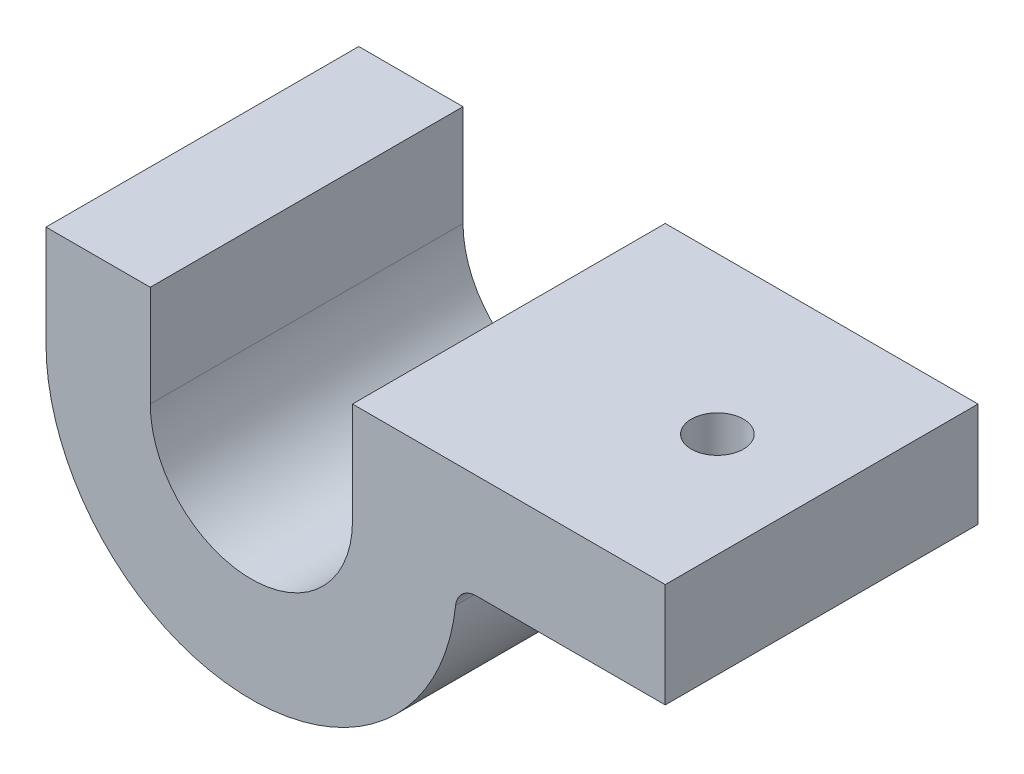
ISO-10303-21;
HEADER;
FILE_DESCRIPTION(('STEP AP214'),'2;1');
FILE_NAME('part.step','',(''),(''),'','','');
FILE_SCHEMA(('AUTOMOTIVE_DESIGN { 1 0 10303 214 1 1 1 1 }'));
ENDSEC;
DATA;
#1=APPLICATION_CONTEXT('core data for automotive mechanical design processes');
#2=APPLICATION_PROTOCOL_DEFINITION('international standard','automotive_design',2000,#1);
#3=PRODUCT_CONTEXT('',#1,'mechanical');
#4=PRODUCT('Part','Part','',(#3));
#5=PRODUCT_RELATED_PRODUCT_CATEGORY('part','',(#4));
#6=PRODUCT_DEFINITION_FORMATION('','',#4);
#7=PRODUCT_DEFINITION_CONTEXT('part definition',#1,'design');
#8=PRODUCT_DEFINITION('design','',#6,#7);
#9=PRODUCT_DEFINITION_SHAPE('','',#8);
#10=(LENGTH_UNIT() NAMED_UNIT(*) SI_UNIT(.MILLI.,.METRE.));
#11=(NAMED_UNIT(*) PLANE_ANGLE_UNIT() SI_UNIT($,.RADIAN.));
#12=(NAMED_UNIT(*) SI_UNIT($,.STERADIAN.) SOLID_ANGLE_UNIT());
#13=UNCERTAINTY_MEASURE_WITH_UNIT(LENGTH_MEASURE(1.E-05),#10,'distance_accuracy_value','');
#14=(GEOMETRIC_REPRESENTATION_CONTEXT(3) GLOBAL_UNCERTAINTY_ASSIGNED_CONTEXT((#13)) GLOBAL_UNIT_ASSIGNED_CONTEXT((#10,
#11,#12)) REPRESENTATION_CONTEXT('',''));
#15=CARTESIAN_POINT('',(0.,0.,0.));
#16=DIRECTION('',(0.,0.,1.));
#17=DIRECTION('',(1.,0.,0.));
#18=AXIS2_PLACEMENT_3D('',#15,#16,#17);
#19=CARTESIAN_POINT('',(-9.85,4.85,-15.));
#20=DIRECTION('',(0.,1.,0.));
#21=DIRECTION('',(0.,0.,1.));
#22=AXIS2_PLACEMENT_3D('',#19,#20,#21);
#23=PLANE('',#22);
#24=DIRECTION('',(-1.,0.,0.));
#25=VECTOR('',#24,1.);
#26=CARTESIAN_POINT('',(-9.85,4.85,0.));
#27=LINE('',#26,#25);
#28=CARTESIAN_POINT('',(-4.85,4.85,0.));
#29=VERTEX_POINT('',#28);
#30=CARTESIAN_POINT('',(-9.85,4.85,0.));
#31=VERTEX_POINT('',#30);
#32=EDGE_CURVE('E157',#29,#31,#27,.T.);
#33=ORIENTED_EDGE('',*,*,#32,.F.);
#34=DIRECTION('',(0.,0.,1.));
#35=VECTOR('',#34,1.);
#36=CARTESIAN_POINT('',(-4.85,4.85,-15.));
#37=LINE('',#36,#35);
#38=CARTESIAN_POINT('',(-4.85,4.85,-15.));
#39=VERTEX_POINT('',#38);
#40=EDGE_CURVE('E131',#39,#29,#37,.T.);
#41=ORIENTED_EDGE('',*,*,#40,.F.);
#42=DIRECTION('',(-1.,0.,0.));
#43=VECTOR('',#42,1.);
#44=CARTESIAN_POINT('',(-9.85,4.85,-15.));
#45=LINE('',#44,#43);
#46=CARTESIAN_POINT('',(-9.85,4.85,-15.));
#47=VERTEX_POINT('',#46);
#48=EDGE_CURVE('E126',#39,#47,#45,.T.);
#49=ORIENTED_EDGE('',*,*,#48,.T.);
#50=DIRECTION('',(0.,0.,1.));
#51=VECTOR('',#50,1.);
#52=CARTESIAN_POINT('',(-9.85,4.85,-15.));
#53=LINE('',#52,#51);
#54=EDGE_CURVE('E108',#47,#31,#53,.T.);
#55=ORIENTED_EDGE('',*,*,#54,.T.);
#56=EDGE_LOOP('',(#33,#41,#49,#55));
#57=FACE_BOUND('',#56,.T.);
#58=ADVANCED_FACE('F33',(#57),#23,.T.);
#59=CARTESIAN_POINT('',(-4.85,4.85,-15.));
#60=DIRECTION('',(1.,0.,0.));
#61=DIRECTION('',(0.,0.,-1.));
#62=AXIS2_PLACEMENT_3D('',#59,#60,#61);
#63=PLANE('',#62);
#64=DIRECTION('',(0.,1.,0.));
#65=VECTOR('',#64,1.);
#66=CARTESIAN_POINT('',(-4.85,4.85,0.));
#67=LINE('',#66,#65);
#68=CARTESIAN_POINT('',(-4.85,0.,0.));
#69=VERTEX_POINT('',#68);
#70=EDGE_CURVE('E132',#69,#29,#67,.T.);
#71=ORIENTED_EDGE('',*,*,#70,.F.);
#72=DIRECTION('',(0.,0.,1.));
#73=VECTOR('',#72,1.);
#74=CARTESIAN_POINT('',(-4.85,0.,-15.));
#75=LINE('',#74,#73);
#76=CARTESIAN_POINT('',(-4.85,0.,-15.));
#77=VERTEX_POINT('',#76);
#78=EDGE_CURVE('E177',#77,#69,#75,.T.);
#79=ORIENTED_EDGE('',*,*,#78,.F.);
#80=DIRECTION('',(0.,1.,0.));
#81=VECTOR('',#80,1.);
#82=CARTESIAN_POINT('',(-4.85,4.85,-15.));
#83=LINE('',#82,#81);
#84=EDGE_CURVE('E119',#77,#39,#83,.T.);
#85=ORIENTED_EDGE('',*,*,#84,.T.);
#86=ORIENTED_EDGE('',*,*,#40,.T.);
#87=EDGE_LOOP('',(#71,#79,#85,#86));
#88=FACE_BOUND('',#87,.T.);
#89=ADVANCED_FACE('F201',(#88),#63,.T.);
#90=CARTESIAN_POINT('',(0.,0.,-15.));
#91=DIRECTION('',(0.,0.,1.));
#92=DIRECTION('',(1.,0.,0.));
#93=AXIS2_PLACEMENT_3D('',#90,#91,#92);
#94=CYLINDRICAL_SURFACE('',#93,4.85);
#95=CARTESIAN_POINT('',(0.,0.,0.));
#96=DIRECTION('',(0.,0.,-1.));
#97=DIRECTION('',(1.,0.,0.));
#98=AXIS2_PLACEMENT_3D('',#95,#96,#97);
#99=CIRCLE('',#98,4.85);
#100=CARTESIAN_POINT('',(4.85,0.,0.));
#101=VERTEX_POINT('',#100);
#102=EDGE_CURVE('E135',#101,#69,#99,.T.);
#103=ORIENTED_EDGE('',*,*,#102,.F.);
#104=DIRECTION('',(0.,0.,1.));
#105=VECTOR('',#104,1.);
#106=CARTESIAN_POINT('',(4.85,0.,-15.));
#107=LINE('',#106,#105);
#108=CARTESIAN_POINT('',(4.85,0.,-15.));
#109=VERTEX_POINT('',#108);
#110=EDGE_CURVE('E179',#109,#101,#107,.T.);
#111=ORIENTED_EDGE('',*,*,#110,.F.);
#112=CARTESIAN_POINT('',(0.,0.,-15.));
#113=DIRECTION('',(0.,0.,-1.));
#114=DIRECTION('',(1.,0.,0.));
#115=AXIS2_PLACEMENT_3D('',#112,#113,#114);
#116=CIRCLE('',#115,4.85);
#117=EDGE_CURVE('E153',#109,#77,#116,.T.);
#118=ORIENTED_EDGE('',*,*,#117,.T.);
#119=ORIENTED_EDGE('',*,*,#78,.T.);
#120=EDGE_LOOP('',(#103,#111,#118,#119));
#121=FACE_BOUND('',#120,.T.);
#122=ADVANCED_FACE('F229',(#121),#94,.F.);
#123=CARTESIAN_POINT('',(4.85,4.85,-15.));
#124=DIRECTION('',(-1.,0.,0.));
#125=DIRECTION('',(0.,0.,1.));
#126=AXIS2_PLACEMENT_3D('',#123,#124,#125);
#127=PLANE('',#126);
#128=DIRECTION('',(0.,-1.,0.));
#129=VECTOR('',#128,1.);
#130=CARTESIAN_POINT('',(4.85,4.85,0.));
#131=LINE('',#130,#129);
#132=CARTESIAN_POINT('',(4.85,4.85,0.));
#133=VERTEX_POINT('',#132);
#134=EDGE_CURVE('E170',#133,#101,#131,.T.);
#135=ORIENTED_EDGE('',*,*,#134,.F.);
#136=DIRECTION('',(0.,0.,1.));
#137=VECTOR('',#136,1.);
#138=CARTESIAN_POINT('',(4.85,4.85,-15.));
#139=LINE('',#138,#137);
#140=CARTESIAN_POINT('',(4.85,4.85,-15.));
#141=VERTEX_POINT('',#140);
#142=EDGE_CURVE('E181',#141,#133,#139,.T.);
#143=ORIENTED_EDGE('',*,*,#142,.F.);
#144=DIRECTION('',(0.,-1.,0.));
#145=VECTOR('',#144,1.);
#146=CARTESIAN_POINT('',(4.85,4.85,-15.));
#147=LINE('',#146,#145);
#148=EDGE_CURVE('E150',#141,#109,#147,.T.);
#149=ORIENTED_EDGE('',*,*,#148,.T.);
#150=ORIENTED_EDGE('',*,*,#110,.T.);
#151=EDGE_LOOP('',(#135,#143,#149,#150));
#152=FACE_BOUND('',#151,.T.);
#153=ADVANCED_FACE('F208',(#152),#127,.T.);
#154=CARTESIAN_POINT('',(4.85,4.85,-15.));
#155=DIRECTION('',(0.,1.,0.));
#156=DIRECTION('',(0.,0.,1.));
#157=AXIS2_PLACEMENT_3D('',#154,#155,#156);
#158=PLANE('',#157);
#159=CARTESIAN_POINT('',(14.8494289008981,4.85,-7.5));
#160=DIRECTION('',(0.,1.,0.));
#161=DIRECTION('',(0.,0.,1.));
#162=AXIS2_PLACEMENT_3D('',#159,#160,#161);
#163=CIRCLE('',#162,1.25);
#164=CARTESIAN_POINT('',(14.8494289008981,4.85,-6.25));
#165=VERTEX_POINT('',#164);
#166=EDGE_CURVE('E138',#165,#165,#163,.T.);
#167=ORIENTED_EDGE('',*,*,#166,.F.);
#168=EDGE_LOOP('',(#167));
#169=FACE_BOUND('',#168,.T.);
#170=DIRECTION('',(-1.,0.,0.));
#171=VECTOR('',#170,1.);
#172=CARTESIAN_POINT('',(4.85,4.85,0.));
#173=LINE('',#172,#171);
#174=CARTESIAN_POINT('',(19.85,4.85,0.));
#175=VERTEX_POINT('',#174);
#176=EDGE_CURVE('E167',#175,#133,#173,.T.);
#177=ORIENTED_EDGE('',*,*,#176,.F.);
#178=DIRECTION('',(0.,0.,1.));
#179=VECTOR('',#178,1.);
#180=CARTESIAN_POINT('',(19.85,4.85,-15.));
#181=LINE('',#180,#179);
#182=CARTESIAN_POINT('',(19.85,4.85,-15.));
#183=VERTEX_POINT('',#182);
#184=EDGE_CURVE('E183',#183,#175,#181,.T.);
#185=ORIENTED_EDGE('',*,*,#184,.F.);
#186=DIRECTION('',(-1.,0.,0.));
#187=VECTOR('',#186,1.);
#188=CARTESIAN_POINT('',(4.85,4.85,-15.));
#189=LINE('',#188,#187);
#190=EDGE_CURVE('E147',#183,#141,#189,.T.);
#191=ORIENTED_EDGE('',*,*,#190,.T.);
#192=ORIENTED_EDGE('',*,*,#142,.T.);
#193=EDGE_LOOP('',(#177,#185,#191,#192));
#194=FACE_BOUND('',#193,.T.);
#195=ADVANCED_FACE('F211',(#169,#194),#158,.T.);
#196=CARTESIAN_POINT('',(19.85,4.85,-15.));
#197=DIRECTION('',(1.,0.,0.));
#198=DIRECTION('',(0.,0.,-1.));
#199=AXIS2_PLACEMENT_3D('',#196,#197,#198);
#200=PLANE('',#199);
#201=DIRECTION('',(0.,1.,0.));
#202=VECTOR('',#201,1.);
#203=CARTESIAN_POINT('',(19.85,4.85,0.));
#204=LINE('',#203,#202);
#205=CARTESIAN_POINT('',(19.85,-0.150000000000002,0.));
#206=VERTEX_POINT('',#205);
#207=EDGE_CURVE('E164',#206,#175,#204,.T.);
#208=ORIENTED_EDGE('',*,*,#207,.F.);
#209=DIRECTION('',(0.,0.,1.));
#210=VECTOR('',#209,1.);
#211=CARTESIAN_POINT('',(19.85,-0.150000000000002,-15.));
#212=LINE('',#211,#210);
#213=CARTESIAN_POINT('',(19.85,-0.150000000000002,-15.));
#214=VERTEX_POINT('',#213);
#215=EDGE_CURVE('E185',#214,#206,#212,.T.);
#216=ORIENTED_EDGE('',*,*,#215,.F.);
#217=DIRECTION('',(0.,1.,0.));
#218=VECTOR('',#217,1.);
#219=CARTESIAN_POINT('',(19.85,4.85,-15.));
#220=LINE('',#219,#218);
#221=EDGE_CURVE('E144',#214,#183,#220,.T.);
#222=ORIENTED_EDGE('',*,*,#221,.T.);
#223=ORIENTED_EDGE('',*,*,#184,.T.);
#224=EDGE_LOOP('',(#208,#216,#222,#223));
#225=FACE_BOUND('',#224,.T.);
#226=ADVANCED_FACE('F216',(#225),#200,.T.);
#227=CARTESIAN_POINT('',(9.8488578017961,-0.150000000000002,-15.));
#228=DIRECTION('',(0.,-1.,0.));
#229=DIRECTION('',(0.,0.,-1.));
#230=AXIS2_PLACEMENT_3D('',#227,#228,#229);
#231=PLANE('',#230);
#232=CARTESIAN_POINT('',(14.8494289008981,-0.150000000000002,-7.5));
#233=DIRECTION('',(0.,-1.,0.));
#234=DIRECTION('',(0.,0.,-1.));
#235=AXIS2_PLACEMENT_3D('',#232,#233,#234);
#236=CIRCLE('',#235,1.25);
#237=CARTESIAN_POINT('',(14.8494289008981,-0.150000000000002,-8.75));
#238=VERTEX_POINT('',#237);
#239=EDGE_CURVE('E327',#238,#238,#236,.T.);
#240=ORIENTED_EDGE('',*,*,#239,.F.);
#241=EDGE_LOOP('',(#240));
#242=FACE_BOUND('',#241,.T.);
#243=DIRECTION('',(1.,0.,0.));
#244=VECTOR('',#243,1.);
#245=CARTESIAN_POINT('',(9.8488578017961,-0.150000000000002,0.));
#246=LINE('',#245,#244);
#247=CARTESIAN_POINT('',(10.7888831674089,-0.150000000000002,0.));
#248=VERTEX_POINT('',#247);
#249=EDGE_CURVE('E162',#248,#206,#246,.T.);
#250=ORIENTED_EDGE('',*,*,#249,.F.);
#251=DIRECTION('',(0.,0.,-1.));
#252=VECTOR('',#251,1.);
#253=CARTESIAN_POINT('',(10.7888831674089,-0.150000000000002,-15.));
#254=LINE('',#253,#252);
#255=CARTESIAN_POINT('',(10.7888831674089,-0.150000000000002,-15.));
#256=VERTEX_POINT('',#255);
#257=EDGE_CURVE('E48',#248,#256,#254,.T.);
#258=ORIENTED_EDGE('',*,*,#257,.T.);
#259=DIRECTION('',(1.,0.,0.));
#260=VECTOR('',#259,1.);
#261=CARTESIAN_POINT('',(9.8488578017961,-0.150000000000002,-15.));
#262=LINE('',#261,#260);
#263=EDGE_CURVE('E142',#256,#214,#262,.T.);
#264=ORIENTED_EDGE('',*,*,#263,.T.);
#265=ORIENTED_EDGE('',*,*,#215,.T.);
#266=EDGE_LOOP('',(#250,#258,#264,#265));
#267=FACE_BOUND('',#266,.T.);
#268=ADVANCED_FACE('F217',(#242,#267),#231,.T.);
#269=CARTESIAN_POINT('',(0.,0.,-15.));
#270=DIRECTION('',(0.,0.,1.));
#271=DIRECTION('',(1.,0.,0.));
#272=AXIS2_PLACEMENT_3D('',#269,#270,#271);
#273=CYLINDRICAL_SURFACE('',#272,9.85);
#274=CARTESIAN_POINT('',(0.,0.,-15.));
#275=DIRECTION('',(0.,0.,1.));
#276=DIRECTION('',(1.,0.,0.));
#277=AXIS2_PLACEMENT_3D('',#274,#275,#276);
#278=CIRCLE('',#277,9.85);
#279=CARTESIAN_POINT('',(-9.85,0.,-15.));
#280=VERTEX_POINT('',#279);
#281=CARTESIAN_POINT('',(9.79451605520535,-1.04400921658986,-15.));
#282=VERTEX_POINT('',#281);
#283=EDGE_CURVE('E129',#280,#282,#278,.T.);
#284=ORIENTED_EDGE('',*,*,#283,.T.);
#285=DIRECTION('',(0.,0.,1.));
#286=VECTOR('',#285,1.);
#287=CARTESIAN_POINT('',(9.79451605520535,-1.04400921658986,-15.));
#288=LINE('',#287,#286);
#289=CARTESIAN_POINT('',(9.79451605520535,-1.04400921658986,0.));
#290=VERTEX_POINT('',#289);
#291=EDGE_CURVE('E176',#282,#290,#288,.T.);
#292=ORIENTED_EDGE('',*,*,#291,.T.);
#293=CARTESIAN_POINT('',(0.,0.,0.));
#294=DIRECTION('',(0.,0.,1.));
#295=DIRECTION('',(1.,0.,0.));
#296=AXIS2_PLACEMENT_3D('',#293,#294,#295);
#297=CIRCLE('',#296,9.85);
#298=CARTESIAN_POINT('',(-9.85,0.,0.));
#299=VERTEX_POINT('',#298);
#300=EDGE_CURVE('E160',#299,#290,#297,.T.);
#301=ORIENTED_EDGE('',*,*,#300,.F.);
#302=DIRECTION('',(0.,0.,1.));
#303=VECTOR('',#302,1.);
#304=CARTESIAN_POINT('',(-9.85,0.,-15.));
#305=LINE('',#304,#303);
#306=EDGE_CURVE('E118',#280,#299,#305,.T.);
#307=ORIENTED_EDGE('',*,*,#306,.F.);
#308=EDGE_LOOP('',(#284,#292,#301,#307));
#309=FACE_BOUND('',#308,.T.);
#310=ADVANCED_FACE('F194',(#309),#273,.T.);
#311=CARTESIAN_POINT('',(-9.85,4.85,-15.));
#312=DIRECTION('',(-1.,0.,0.));
#313=DIRECTION('',(0.,0.,1.));
#314=AXIS2_PLACEMENT_3D('',#311,#312,#313);
#315=PLANE('',#314);
#316=DIRECTION('',(0.,-1.,0.));
#317=VECTOR('',#316,1.);
#318=CARTESIAN_POINT('',(-9.85,4.85,0.));
#319=LINE('',#318,#317);
#320=EDGE_CURVE('E113',#31,#299,#319,.T.);
#321=ORIENTED_EDGE('',*,*,#320,.F.);
#322=ORIENTED_EDGE('',*,*,#54,.F.);
#323=DIRECTION('',(0.,-1.,0.));
#324=VECTOR('',#323,1.);
#325=CARTESIAN_POINT('',(-9.85,4.85,-15.));
#326=LINE('',#325,#324);
#327=EDGE_CURVE('E111',#47,#280,#326,.T.);
#328=ORIENTED_EDGE('',*,*,#327,.T.);
#329=ORIENTED_EDGE('',*,*,#306,.T.);
#330=EDGE_LOOP('',(#321,#322,#328,#329));
#331=FACE_BOUND('',#330,.T.);
#332=ADVANCED_FACE('F110',(#331),#315,.T.);
#333=CARTESIAN_POINT('',(0.,0.,-15.));
#334=DIRECTION('',(0.,0.,1.));
#335=DIRECTION('',(1.,0.,0.));
#336=AXIS2_PLACEMENT_3D('',#333,#334,#335);
#337=PLANE('',#336);
#338=ORIENTED_EDGE('',*,*,#48,.F.);
#339=ORIENTED_EDGE('',*,*,#84,.F.);
#340=ORIENTED_EDGE('',*,*,#117,.F.);
#341=ORIENTED_EDGE('',*,*,#148,.F.);
#342=ORIENTED_EDGE('',*,*,#190,.F.);
#343=ORIENTED_EDGE('',*,*,#221,.F.);
#344=ORIENTED_EDGE('',*,*,#263,.F.);
#345=CARTESIAN_POINT('',(10.7888831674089,-1.15,-15.));
#346=DIRECTION('',(0.,0.,1.));
#347=DIRECTION('',(1.,0.,0.));
#348=AXIS2_PLACEMENT_3D('',#345,#346,#347);
#349=CIRCLE('',#348,1.);
#350=EDGE_CURVE('E11',#256,#282,#349,.T.);
#351=ORIENTED_EDGE('',*,*,#350,.T.);
#352=ORIENTED_EDGE('',*,*,#283,.F.);
#353=ORIENTED_EDGE('',*,*,#327,.F.);
#354=EDGE_LOOP('',(#338,#339,#340,#341,#342,#343,#344,#351,#352,#353));
#355=FACE_BOUND('',#354,.T.);
#356=ADVANCED_FACE('F124',(#355),#337,.F.);
#357=CARTESIAN_POINT('',(0.,0.,0.));
#358=DIRECTION('',(0.,0.,1.));
#359=DIRECTION('',(1.,0.,0.));
#360=AXIS2_PLACEMENT_3D('',#357,#358,#359);
#361=PLANE('',#360);
#362=ORIENTED_EDGE('',*,*,#32,.T.);
#363=ORIENTED_EDGE('',*,*,#320,.T.);
#364=ORIENTED_EDGE('',*,*,#300,.T.);
#365=CARTESIAN_POINT('',(10.7888831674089,-1.15,0.));
#366=DIRECTION('',(0.,0.,1.));
#367=DIRECTION('',(1.,0.,0.));
#368=AXIS2_PLACEMENT_3D('',#365,#366,#367);
#369=CIRCLE('',#368,1.);
#370=EDGE_CURVE('E41',#290,#248,#369,.F.);
#371=ORIENTED_EDGE('',*,*,#370,.T.);
#372=ORIENTED_EDGE('',*,*,#249,.T.);
#373=ORIENTED_EDGE('',*,*,#207,.T.);
#374=ORIENTED_EDGE('',*,*,#176,.T.);
#375=ORIENTED_EDGE('',*,*,#134,.T.);
#376=ORIENTED_EDGE('',*,*,#102,.T.);
#377=ORIENTED_EDGE('',*,*,#70,.T.);
#378=EDGE_LOOP('',(#362,#363,#364,#371,#372,#373,#374,#375,#376,#377));
#379=FACE_BOUND('',#378,.T.);
#380=ADVANCED_FACE('F197',(#379),#361,.T.);
#381=CARTESIAN_POINT('',(14.8494289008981,14.85,-7.5));
#382=DIRECTION('',(0.,-1.,0.));
#383=DIRECTION('',(0.,0.,-1.));
#384=AXIS2_PLACEMENT_3D('',#381,#382,#383);
#385=CYLINDRICAL_SURFACE('',#384,1.25);
#386=ORIENTED_EDGE('',*,*,#166,.T.);
#387=EDGE_LOOP('',(#386));
#388=FACE_BOUND('',#387,.T.);
#389=ORIENTED_EDGE('',*,*,#239,.T.);
#390=EDGE_LOOP('',(#389));
#391=FACE_BOUND('',#390,.T.);
#392=ADVANCED_FACE('F219',(#388,#391),#385,.F.);
#393=CARTESIAN_POINT('',(10.7888831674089,-1.15,-15.));
#394=DIRECTION('',(0.,0.,1.));
#395=DIRECTION('',(1.,0.,0.));
#396=AXIS2_PLACEMENT_3D('',#393,#394,#395);
#397=CYLINDRICAL_SURFACE('',#396,1.);
#398=ORIENTED_EDGE('',*,*,#350,.F.);
#399=ORIENTED_EDGE('',*,*,#257,.F.);
#400=ORIENTED_EDGE('',*,*,#370,.F.);
#401=ORIENTED_EDGE('',*,*,#291,.F.);
#402=EDGE_LOOP('',(#398,#399,#400,#401));
#403=FACE_BOUND('',#402,.T.);
#404=ADVANCED_FACE('F35',(#403),#397,.F.);
#405=CLOSED_SHELL('',(#58,#89,#122,#153,#195,#226,#268,#310,#332,#356,#380,#392,#404));
#406=MANIFOLD_SOLID_BREP('B2',#405);
#407=ADVANCED_BREP_SHAPE_REPRESENTATION('',(#18,#406),#14);
#408=SHAPE_DEFINITION_REPRESENTATION(#9,#407);
ENDSEC;
END-ISO-10303-21;
